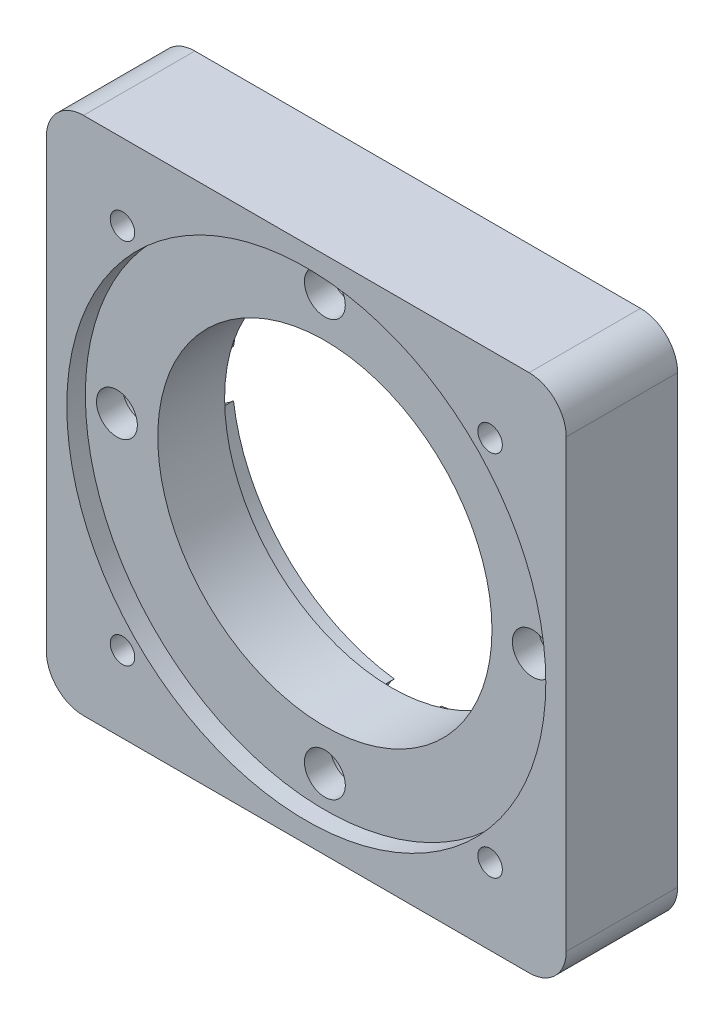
from build123d import *

# Parameters (mm, degrees)
EXTRUDE_1_DEPTH          = 15
SKETCH_2_R               = 32.25
CUT_EXTRUDE_1_DEPTH      = 2.5
SKETCH_3_R               = 2.75
CUT_EXTRUDE_2_DEPTH      = 12.5
SKETCH_4_R               = 4.5
CUT_EXTRUDE_3_DEPTH      = 9
PATTERN_CIRCULAR_1_COUNT = 4
SKETCH_5_R               = 25
CUT_EXTRUDE_4_DEPTH      = 3.5
SKETCH_6_R               = 22.5
CUT_EXTRUDE_5_DEPTH      = 13.5
HOLE_WIZARD_M4_1_D       = 3.3
PATTERN_CIRCULAR_2_COUNT = 4


with BuildPart() as part:
    # Sketch 1 → Extrude 1 (new body)
    with BuildSketch(Plane.XY):
        with BuildLine():
            Line((-30, -35), (30, -35))
            ThreePointArc((30, -35), (33.535533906, -33.535533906), (35, -30))
            Line((35, -30), (35, 30))
            ThreePointArc((35, 30), (33.535533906, 33.535533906), (30, 35))
            Line((30, 35), (-30, 35))
            ThreePointArc((-30, 35), (-33.535533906, 33.535533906), (-35, 30))
            Line((-35, 30), (-35, -30))
            ThreePointArc((-35, -30), (-33.535533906, -33.535533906), (-30, -35))
        make_face()
    extrude(amount=EXTRUDE_1_DEPTH)

    # Sketch 2 → Cut-Extrude 1 (cut)
    with BuildSketch(Plane.XY.offset(15)):
        Circle(SKETCH_2_R)
    extrude(amount=-CUT_EXTRUDE_1_DEPTH, mode=Mode.SUBTRACT)

    # Sketch 3 → Cut-Extrude 2 (cut)
    with BuildSketch(Plane.XY.offset(12.5)):
        with Locations((0, 28)):
            Circle(SKETCH_3_R)
    cut_extrude_2 = extrude(amount=-CUT_EXTRUDE_2_DEPTH, mode=Mode.SUBTRACT)

    # Sketch 4 → Cut-Extrude 3 (cut)
    with BuildSketch(Plane(origin=(0, 0, 0), x_dir=(-1, 0, 0), z_dir=(0, 0, -1))):
        with Locations((0, 28)):
            Circle(SKETCH_4_R)
    cut_extrude_3 = extrude(amount=-CUT_EXTRUDE_3_DEPTH, mode=Mode.SUBTRACT)

    # Pattern Circular 1: Cut-Extrude 2, Cut-Extrude 3 ×4 about axis
    pattern_circular_1_axis = Axis((0, 0, 0), (0, 0, 1))
    add([cut_extrude_2.rotate(pattern_circular_1_axis, i * 360 / PATTERN_CIRCULAR_1_COUNT) for i in range(1, PATTERN_CIRCULAR_1_COUNT)], mode=Mode.SUBTRACT)
    add([cut_extrude_3.rotate(pattern_circular_1_axis, i * 360 / PATTERN_CIRCULAR_1_COUNT) for i in range(1, PATTERN_CIRCULAR_1_COUNT)], mode=Mode.SUBTRACT)

    # Sketch 5 → Cut-Extrude 4 (cut)
    with BuildSketch(Plane(origin=(0, 0, 0), x_dir=(-1, 0, 0), z_dir=(0, 0, -1))):
        Circle(SKETCH_5_R)
    extrude(amount=-CUT_EXTRUDE_4_DEPTH, mode=Mode.SUBTRACT)

    # Sketch 6 → Cut-Extrude 5 (cut)
    with BuildSketch(Plane.XY.offset(12.5)):
        Circle(SKETCH_6_R)
    extrude(amount=-CUT_EXTRUDE_5_DEPTH, mode=Mode.SUBTRACT)

    # Hole Wizard M4 _1 (through all)
    with Locations(Plane(origin=(-24.748737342, 24.748737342, 0), x_dir=(-1, 0, 0), z_dir=(0, 0, -1))):
        with Locations((0, 0)):
            hole_wizard_m4_1 = Hole(HOLE_WIZARD_M4_1_D / 2)

    # Pattern Circular 2: Hole Wizard M4 _1 ×4 about axis
    pattern_circular_2_axis = Axis((0, 0, 0), (0, 0, 1))
    for i in range(1, PATTERN_CIRCULAR_2_COUNT):
        add(hole_wizard_m4_1.rotate(pattern_circular_2_axis, i * 360 / PATTERN_CIRCULAR_2_COUNT), mode=Mode.SUBTRACT)


solid = part.part
